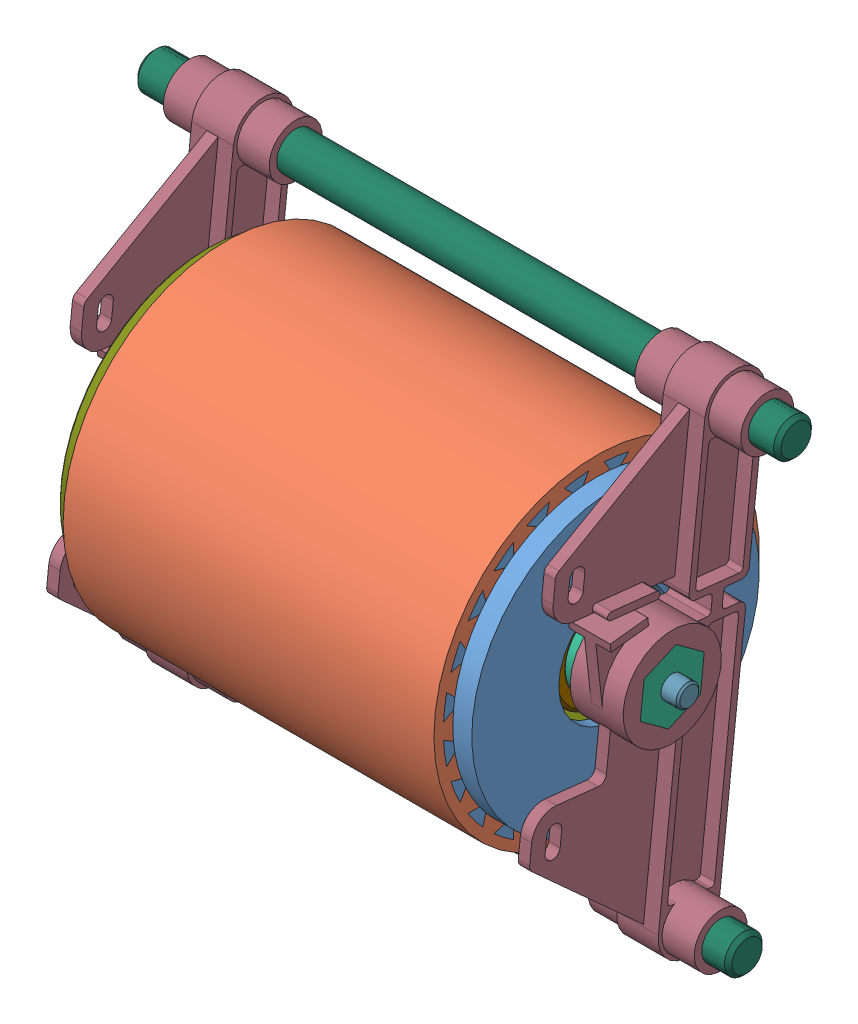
SolidWorks assembly TP_GALET_COMPLET_PROF.SLDASM, configuration Défaut (file format 11000). Lengths in mm.
Overall size (170.68 133.57 103.59).
73 component instances, 16 part files, 33 mates.
Components (placement in the parent):
- tambour-1: tambour.SLDASM [Défaut] at (9.972 -7.3054 103) size (103 86 86)
  - galet-1: galet.SLDPRT [Défaut] at origin size (103 80.89 80.89)
  - bandage-1: bandage.SLDPRT [Défaut] at (-68.3031 0 0) x (0 0 1) z (-1 0 0) size (86 86 98)
- masselottes-1: masselottes.SLDASM [Défaut] at (-20.631 -14.3257 99.1438) x (0 0.822588 -0.568638) z (-1 0 0) size (55.58 25 45.6)
  - porte masselottes-1: porte masselottes.SLDPRT [Défaut] at (3.5821 -7.1641 -22.8) size (54 25 45.6)
  - grifaxe 4-1: grifaxe 4.SLDPRT [Défaut] at (23.5821 -7.1641 20.2651) x (0.927854 -0.372944 0) z (-0.372944 -0.927854 0) size (12 1.5 12)
  - grifaxe 4-2: grifaxe 4.SLDPRT [Défaut] at (-16.4179 -7.1641 20.7651) x (0.364962 -0.931022 0) z (-0.931022 -0.364962 0) size (12 1.5 12)
- support de masselotte-1: support de masselotte.SLDPRT [Défaut] at (-31.331 9.1464 91.6272) x (0 -0.208834 0.977951) z (1 0 0) size (53.7 37.74 19)
- support de masselotte-2: support de masselotte.SLDPRT [Défaut] at (-31.331 -23.7572 114.3728) x (0 0.155184 -0.987886) z (1 0 0) size (53.7 37.74 19)
- 3pignons fixes-1: 3pignons fixes.SLDASM [Défaut] at (28.669 -7.3054 103) x (0 0.402782 -0.915296) z (1 0 0) size (50.67 48.95 52.1)
  - axe 3p-1: axe 3p.SLDPRT [Défaut] at origin size (49.57 44.88 52.1)
  - grifaxe 4-2: grifaxe 4.SLDPRT [Défaut] at (-17.189 -9.8146 -18.5651) x (0.506463 -0.862262 0) z (0.862262 0.506463 0) size (12 1.5 12)
  - roulement-1: roulement.SLDASM [Défaut] at (0 0 8) x (0 0 1) z (0.021651 0.999766 0) size (10 42 42)
    - B Exter-1: B Exter.SLDPRT [Défaut] at origin size (10 42 42)
    - bille-1: bille.SLDPRT [5b] at (0 15.5 0) size (5 5 5)
    - bille-2: bille.SLDPRT [5b] at (0 14.7414 4.7898) x (1 0 0) z (0 -0.309017 0.951057) size (5 5 5)
    - bille-3: bille.SLDPRT [5b] at (0 12.5398 9.1107) x (1 0 0) z (0 -0.587785 0.809017) size (5 5 5)
    - bille-4: bille.SLDPRT [5b] at (0 9.1107 12.5398) x (1 0 0) z (0 -0.809017 0.587785) size (5 5 5)
    - bille-5: bille.SLDPRT [5b] at (0 4.7898 14.7414) x (1 0 0) z (0 -0.951057 0.309017) size (5 5 5)
    - bille-6: bille.SLDPRT [5b] at (0 0 15.5) x (1 0 0) z (0 -1 0) size (5 5 5)
    - bille-7: bille.SLDPRT [5b] at (0 -4.7898 14.7414) x (1 0 0) z (0 -0.951057 -0.309017) size (5 5 5)
    - bille-8: bille.SLDPRT [5b] at (0 -9.1107 12.5398) x (1 0 0) z (0 -0.809017 -0.587785) size (5 5 5)
    - bille-9: bille.SLDPRT [5b] at (0 -12.5398 9.1107) x (1 0 0) z (0 -0.587785 -0.809017) size (5 5 5)
    - bille-10: bille.SLDPRT [5b] at (0 -14.7414 4.7898) x (1 0 0) z (0 -0.309017 -0.951057) size (5 5 5)
    - bille-11: bille.SLDPRT [5b] at (0 -15.5 0) x (1 0 0) z (0 0 -1) size (5 5 5)
    - bille-12: bille.SLDPRT [5b] at (0 -14.7414 -4.7898) x (1 0 0) z (0 0.309017 -0.951057) size (5 5 5)
    - bille-13: bille.SLDPRT [5b] at (0 -12.5398 -9.1107) x (1 0 0) z (0 0.587785 -0.809017) size (5 5 5)
    - bille-14: bille.SLDPRT [5b] at (0 -9.1107 -12.5398) x (1 0 0) z (0 0.809017 -0.587785) size (5 5 5)
    - bille-15: bille.SLDPRT [5b] at (0 -4.7898 -14.7414) x (1 0 0) z (0 0.951057 -0.309017) size (5 5 5)
    - bille-16: bille.SLDPRT [5b] at (0 0 -15.5) x (1 0 0) z (0 1 0) size (5 5 5)
    - bille-17: bille.SLDPRT [5b] at (0 4.7898 -14.7414) x (1 0 0) z (0 0.951057 0.309017) size (5 5 5)
    - bille-18: bille.SLDPRT [5b] at (0 9.1107 -12.5398) x (1 0 0) z (0 0.809017 0.587785) size (5 5 5)
    - bille-19: bille.SLDPRT [5b] at (0 12.5398 -9.1107) x (1 0 0) z (0 0.587785 0.809017) size (5 5 5)
    - bille-20: bille.SLDPRT [5b] at (0 14.7414 -4.7898) x (1 0 0) z (0 0.309017 0.951057) size (5 5 5)
    - B Int-1: B Int.SLDPRT [Défaut] at origin size (10 27 27)
  - grifaxe 4-3: grifaxe 4.SLDPRT [Défaut] at (0.0948 19.7934 -18.5651) x (-0.999972 -0.007479 0) z (0.007479 -0.999972 0) size (12 1.5 12)
  - grifaxe 4-4: grifaxe 4.SLDPRT [Défaut] at (17.0942 -9.9788 -18.5651) x (0.493509 0.869741 0) z (-0.869741 0.493509 0) size (12 1.5 12)
- train intermédiaire-1: train intermédiaire.SLDASM [Défaut] at (24.669 -7.3054 103) x (0 0 1) z (-1 0 0) size (55.98 25 39)
  - porte satellites-1: porte satellites.SLDPRT [Défaut] at origin size (54.5 25 39)
  - grifaxe 4-1: grifaxe 4.SLDPRT [Défaut] at (-20.25 0 36.4651) x (0.674548 -0.738231 0) z (-0.738231 -0.674548 0) size (12 1.5 12)
  - grifaxe 4-2: grifaxe 4.SLDPRT [Défaut] at (20.25 0 36.4651) x (0.995455 0.09523 0) z (0.09523 -0.995455 0) size (12 1.5 12)
- axe fou-1: axe fou.SLDPRT [Défaut] at (-47.9524 -7.3054 103) x (0 0.994061 -0.108828) z (-1 0 0) size (28 28 31)
- pignon 16 dents-1: pignon 16 dents.SLDPRT [Défaut] at (1.669 -7.3054 82.75) x (0 0 1) z (-1 0 0) size (26.59 26.59 13)
- pignon 16 dents-2: pignon 16 dents.SLDPRT [Défaut] at (23.169 -23.6364 114.9734) x (0 0 1) z (-1 0 0) size (26.59 26.59 13)
- levier-1: levier.SLDPRT [Défaut] at (52.669 -7.3054 103) x (0 -0.994061 0.108828) z (1 0 0) size (129 49 28)
- levier-2: levier.SLDPRT [Défaut] at (-71.9524 -7.3054 103) x (0 -0.994061 0.108828) z (1 0 0) size (129 49 28)
- axe-1: axe.SLDPRT [Défaut] at (-9.831 -7.3054 103) x (0 0.052941 -0.998598) z (-1 0 0) size (8 8 148)
- Tige-2: Tige.SLDPRT [Défaut] at (-96.3424 -64.7758 97.2201) x (0 0.947525 0.319682) z (1 0 0) size (10 10 170)
- Tige-3: Tige.SLDPRT [Défaut] at (-95.6597 47.5531 84.9225) x (0 0.996897 0.078716) z (1 0 0) size (10 10 170)
- flasque-1: flasque.SLDPRT [Défaut] at (-63.331 -7.3054 103) x (0 -0.914092 -0.405507) z (1 0 0) size (78.5 78.5 15.66)
- roulement-1: roulement.SLDASM [Défaut] at (-55.331 -7.3054 103) size (10 42 42)
  - B Exter-1: B Exter.SLDPRT [Défaut] at origin size (10 42 42)
  - bille-1: bille.SLDPRT [5b] at (0 15.5 0) size (5 5 5)
  - bille-2: bille.SLDPRT [5b] at (0 14.7414 4.7898) x (1 0 0) z (0 -0.309017 0.951057) size (5 5 5)
  - bille-3: bille.SLDPRT [5b] at (0 12.5398 9.1107) x (1 0 0) z (0 -0.587785 0.809017) size (5 5 5)
  - bille-4: bille.SLDPRT [5b] at (0 9.1107 12.5398) x (1 0 0) z (0 -0.809017 0.587785) size (5 5 5)
  - bille-5: bille.SLDPRT [5b] at (0 4.7898 14.7414) x (1 0 0) z (0 -0.951057 0.309017) size (5 5 5)
  - bille-6: bille.SLDPRT [5b] at (0 0 15.5) x (1 0 0) z (0 -1 0) size (5 5 5)
  - bille-7: bille.SLDPRT [5b] at (0 -4.7898 14.7414) x (1 0 0) z (0 -0.951057 -0.309017) size (5 5 5)
  - bille-8: bille.SLDPRT [5b] at (0 -9.1107 12.5398) x (1 0 0) z (0 -0.809017 -0.587785) size (5 5 5)
  - bille-9: bille.SLDPRT [5b] at (0 -12.5398 9.1107) x (1 0 0) z (0 -0.587785 -0.809017) size (5 5 5)
  - bille-10: bille.SLDPRT [5b] at (0 -14.7414 4.7898) x (1 0 0) z (0 -0.309017 -0.951057) size (5 5 5)
  - bille-11: bille.SLDPRT [5b] at (0 -15.5 0) x (1 0 0) z (0 0 -1) size (5 5 5)
  - bille-12: bille.SLDPRT [5b] at (0 -14.7414 -4.7898) x (1 0 0) z (0 0.309017 -0.951057) size (5 5 5)
  - bille-13: bille.SLDPRT [5b] at (0 -12.5398 -9.1107) x (1 0 0) z (0 0.587785 -0.809017) size (5 5 5)
  - bille-14: bille.SLDPRT [5b] at (0 -9.1107 -12.5398) x (1 0 0) z (0 0.809017 -0.587785) size (5 5 5)
  - bille-15: bille.SLDPRT [5b] at (0 -4.7898 -14.7414) x (1 0 0) z (0 0.951057 -0.309017) size (5 5 5)
  - bille-16: bille.SLDPRT [5b] at (0 0 -15.5) x (1 0 0) z (0 1 0) size (5 5 5)
  - bille-17: bille.SLDPRT [5b] at (0 4.7898 -14.7414) x (1 0 0) z (0 0.951057 0.309017) size (5 5 5)
  - bille-18: bille.SLDPRT [5b] at (0 9.1107 -12.5398) x (1 0 0) z (0 0.809017 0.587785) size (5 5 5)
  - bille-19: bille.SLDPRT [5b] at (0 12.5398 -9.1107) x (1 0 0) z (0 0.587785 0.809017) size (5 5 5)
  - bille-20: bille.SLDPRT [5b] at (0 14.7414 -4.7898) x (1 0 0) z (0 0.309017 0.951057) size (5 5 5)
  - B Int-1: B Int.SLDPRT [Défaut] at origin size (10 27 27)
Mates (geometry in assembly coordinates):
- Coaxiale1: concentric: cylinder of tambour-1/galet-1 through (-58.331 -7.3054 103) axis (-1 0 0) radius 21; cylinder of ? through (78.2973 -7.3054 103) axis (1 0 0) radius 21
- Coïncidente1: coincident: plane of tambour-1/galet-1 through (41.669 7.6946 103) normal (-1 0 0); plane of ? through (41.669 0.5435 84.0621) normal (1 0 0)
- Coaxiale3: concentric: cylinder of 3pignons fixes-1/axe 3p-1 through (10.069 -23.6364 114.9734) axis (1 0 0) radius 4.95; cylinder of pignon 16 dents-2 through (23.169 -23.6364 114.9734) axis (-1 0 0) radius 5.15
- Coïncidente3: coincident: plane of 3pignons fixes-1/axe 3p-1 through (23.169 -23.6364 114.9734) normal (-1 0 0); plane of pignon 16 dents-2 through (23.169 -23.6364 114.9734) normal (1 0 0)
- Coaxiale4: concentric: cylinder of train intermédiaire-1/porte satellites-1 through (-11.831 -7.3054 82.75) axis (1 0 0) radius 5; cylinder of pignon 16 dents-1 through (1.669 -7.3054 82.75) axis (-1 0 0) radius 5.15
- Coïncidente4: coincident: plane of train intermédiaire-1/porte satellites-1 through (1.669 -7.3054 82.75) normal (-1 0 0); plane of pignon 16 dents-1 through (1.669 -7.3054 82.75) normal (1 0 0)
- Coïncidente5: coincident: plane of 3pignons fixes-1/axe 3p-1 through (24.669 -7.3054 103) normal (-1 0 0); plane of train intermédiaire-1/porte satellites-1 through (24.669 -7.3054 103) normal (1 0 0)
- Coaxiale7: concentric: cylinder of masselottes-1/porte masselottes-1 through (-40.931 9.1464 91.6272) axis (1 0 0) radius 5; cylinder of support de masselotte-1 through (-20.831 9.1464 91.6272) axis (-1 0 0) radius 5
- Coïncidente6: coincident: plane of masselottes-1/porte masselottes-1 through (-20.831 9.1464 91.6272) normal (-1 0 0); plane of support de masselotte-1 through (-20.831 9.1464 91.6272) normal (1 0 0)
- Coaxiale8: concentric: cylinder of masselottes-1/porte masselottes-1 through (-40.931 -23.7572 114.3728) axis (1 0 0) radius 5; cylinder of support de masselotte-2 through (-20.831 -23.7572 114.3728) axis (-1 0 0) radius 5
- Coïncidente8: coincident: plane of masselottes-1/porte masselottes-1 through (-20.831 -23.7572 114.3728) normal (-1 0 0); plane of support de masselotte-2 through (-20.831 -23.7572 114.3728) normal (1 0 0)
- Coïncidente9: coincident: plane of masselottes-1/porte masselottes-1 through (2.169 -7.3054 103) normal (1 0 0); plane of train intermédiaire-1/porte satellites-1 through (2.169 -7.3054 103) normal (-1 0 0)
- Coaxiale10: concentric: cylinder of axe fou-1 through (-50.9524 -7.3054 103) axis (-1 0 0) radius 10; cylinder of axe-1 through (-74.831 -7.3054 103) axis (1 0 0) radius 4
- Coaxiale11: concentric: cylinder of masselottes-1/porte masselottes-1 through (-43.331 -7.3054 103) axis (1 0 0) radius 7; cylinder of axe-1 through (-74.831 -7.3054 103) axis (1 0 0) radius 4
- Coaxiale12: concentric: cylinder of 3pignons fixes-1/axe 3p-1 through (31.669 -7.3054 103) axis (1 0 0) radius 10; cylinder of axe-1 through (-83.831 -7.3054 103) axis (1 0 0) radius 3
- Coaxiale13: concentric: cylinder of train intermédiaire-1/porte satellites-1 through (24.669 -7.3054 103) axis (-1 0 0) radius 4.05; cylinder of axe-1 through (-74.831 -7.3054 103) axis (1 0 0) radius 4
- Coaxiale14: concentric: cylinder of levier-1 through (38.669 47.5531 84.9225) axis (1 0 0) radius 5; cylinder of Tige-3 through (74.3403 47.5531 84.9225) axis (-1 0 0) radius 5
- Coaxiale15: concentric: cylinder of levier-1 through (38.669 -64.7758 97.2201) axis (1 0 0) radius 5; cylinder of Tige-2 through (73.6576 -64.7758 97.2201) axis (-1 0 0) radius 5
- Coaxiale16: concentric: cylinder of levier-2 through (-85.9524 47.5531 84.9225) axis (1 0 0) radius 5; cylinder of Tige-3 through (74.3403 47.5531 84.9225) axis (-1 0 0) radius 5
- Coaxiale17: concentric: cylinder of levier-2 through (-85.9524 -64.7758 97.2201) axis (1 0 0) radius 5; cylinder of Tige-2 through (73.6576 -64.7758 97.2201) axis (-1 0 0) radius 5
- Coaxiale18: concentric: cylinder of axe fou-1 through (-50.9524 -7.3054 103) axis (-1 0 0) radius 10; cylinder of levier-2 through (-64.9524 -7.3054 103) axis (-1 0 0) radius 13
- Coïncidente14: coincident: plane of axe fou-1 through (-64.9524 -16.4881 104.0053) normal (0 -0.806468 0.591278); plane of levier-2 through (-85.9524 -16.4881 104.0053) normal (0 0.806468 -0.591278)
- Coïncidente15: coincident: plane of axe fou-1 through (-78.9524 -7.3054 103) normal (-1 0 0); plane of levier-2 through (-78.9524 -7.3054 103) normal (-1 0 0)
- Coïncidente16: coincident: plane of 3pignons fixes-1/axe 3p-1 through (45.669 -16.4881 104.0053) normal (0 -0.915296 -0.402782); plane of levier-1 through (38.669 -12.7674 95.5502) normal (0 0.915296 0.402782)
- Coaxiale19: concentric: cylinder of 3pignons fixes-1/axe 3p-1 through (31.669 -7.3054 103) axis (1 0 0) radius 10; cylinder of levier-1 through (59.669 -7.3054 103) axis (-1 0 0) radius 13
- Coïncidente17: coincident: plane of 3pignons fixes-1/axe 3p-1 through (59.669 -7.3054 103) normal (1 0 0); plane of levier-1 through (59.669 -7.3054 103) normal (1 0 0)
- Coaxiale20: concentric: cylinder of tambour-1/galet-1 through (-58.331 -7.3054 103) axis (-1 0 0) radius 34.5; cylinder of flasque-1 through (-47.831 -7.3054 103) axis (-1 0 0) radius 34.5
- Coaxiale21: concentric: cylinder of axe fou-1 through (-50.9524 -7.3054 103) axis (-1 0 0) radius 10; cylinder of roulement-1/B Int-1 through (-62.1646 -7.3054 103) axis (-1 0 0) radius 10
- Coïncidente19: coincident: plane of flasque-1 through (-60.331 -7.3054 103) normal (1 0 0); plane of roulement-1/B Exter-1 through (-60.331 10.1946 103) normal (-1 0 0)
- Coïncidente20: coincident: plane of tambour-1/galet-1 through (-58.331 27.1946 103) normal (-1 0 0); plane of flasque-1 through (-58.331 -7.3054 103) normal (1 0 0)
- Distance1: distance = 1.6214 mm: plane of flasque-1 through (-63.331 -7.3054 103) normal (-1 0 0); plane of levier-2 through (-64.9524 -7.3054 103) normal (1 0 0)
- Distance4: distance = 4.5 mm: plane of levier-1 through (59.669 -7.3054 103) normal (1 0 0); plane of axe-1 through (64.169 -7.3054 103) normal (1 0 0)
- Coaxiale22: concentric: cylinder of tambour-1/bandage-1 through (39.669 -7.3054 103) axis (-1 0 0) radius 43; cylinder of axe-1 through (64.169 -7.3054 103) axis (-1 0 0) radius 3
